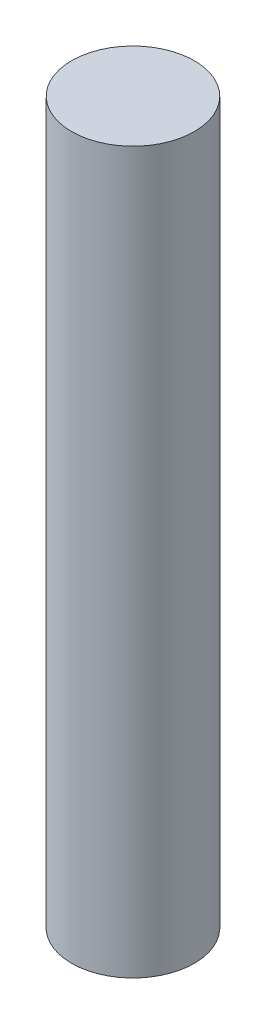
ISO-10303-21;
HEADER;
FILE_DESCRIPTION(('STEP AP214'),'2;1');
FILE_NAME('part.step','',(''),(''),'','','');
FILE_SCHEMA(('AUTOMOTIVE_DESIGN { 1 0 10303 214 1 1 1 1 }'));
ENDSEC;
DATA;
#1=APPLICATION_CONTEXT('core data for automotive mechanical design processes');
#2=APPLICATION_PROTOCOL_DEFINITION('international standard','automotive_design',2000,#1);
#3=PRODUCT_CONTEXT('',#1,'mechanical');
#4=PRODUCT('Part','Part','',(#3));
#5=PRODUCT_RELATED_PRODUCT_CATEGORY('part','',(#4));
#6=PRODUCT_DEFINITION_FORMATION('','',#4);
#7=PRODUCT_DEFINITION_CONTEXT('part definition',#1,'design');
#8=PRODUCT_DEFINITION('design','',#6,#7);
#9=PRODUCT_DEFINITION_SHAPE('','',#8);
#10=(LENGTH_UNIT() NAMED_UNIT(*) SI_UNIT(.MILLI.,.METRE.));
#11=(NAMED_UNIT(*) PLANE_ANGLE_UNIT() SI_UNIT($,.RADIAN.));
#12=(NAMED_UNIT(*) SI_UNIT($,.STERADIAN.) SOLID_ANGLE_UNIT());
#13=UNCERTAINTY_MEASURE_WITH_UNIT(LENGTH_MEASURE(1.E-05),#10,'distance_accuracy_value','');
#14=(GEOMETRIC_REPRESENTATION_CONTEXT(3) GLOBAL_UNCERTAINTY_ASSIGNED_CONTEXT((#13)) GLOBAL_UNIT_ASSIGNED_CONTEXT((#10,
#11,#12)) REPRESENTATION_CONTEXT('',''));
#15=CARTESIAN_POINT('',(0.,0.,0.));
#16=DIRECTION('',(0.,0.,1.));
#17=DIRECTION('',(1.,0.,0.));
#18=AXIS2_PLACEMENT_3D('',#15,#16,#17);
#19=CARTESIAN_POINT('',(0.,27.94,0.));
#20=DIRECTION('',(0.,-1.,0.));
#21=DIRECTION('',(0.,0.,-1.));
#22=AXIS2_PLACEMENT_3D('',#19,#20,#21);
#23=CYLINDRICAL_SURFACE('',#22,4.7625);
#24=CARTESIAN_POINT('',(0.,27.94,0.));
#25=DIRECTION('',(0.,1.,0.));
#26=DIRECTION('',(0.,0.,1.));
#27=AXIS2_PLACEMENT_3D('',#24,#25,#26);
#28=CIRCLE('',#27,4.7625);
#29=CARTESIAN_POINT('',(0.,27.94,4.7625));
#30=VERTEX_POINT('',#29);
#31=EDGE_CURVE('E10',#30,#30,#28,.T.);
#32=ORIENTED_EDGE('',*,*,#31,.F.);
#33=EDGE_LOOP('',(#32));
#34=FACE_BOUND('',#33,.T.);
#35=CARTESIAN_POINT('',(0.,-27.94,0.));
#36=DIRECTION('',(0.,1.,0.));
#37=DIRECTION('',(0.,0.,1.));
#38=AXIS2_PLACEMENT_3D('',#35,#36,#37);
#39=CIRCLE('',#38,4.7625);
#40=CARTESIAN_POINT('',(0.,-27.94,4.7625));
#41=VERTEX_POINT('',#40);
#42=EDGE_CURVE('E36',#41,#41,#39,.T.);
#43=ORIENTED_EDGE('',*,*,#42,.T.);
#44=EDGE_LOOP('',(#43));
#45=FACE_BOUND('',#44,.T.);
#46=ADVANCED_FACE('F33',(#34,#45),#23,.T.);
#47=CARTESIAN_POINT('',(0.,27.94,0.));
#48=DIRECTION('',(0.,1.,0.));
#49=DIRECTION('',(0.,0.,1.));
#50=AXIS2_PLACEMENT_3D('',#47,#48,#49);
#51=PLANE('',#50);
#52=ORIENTED_EDGE('',*,*,#31,.T.);
#53=EDGE_LOOP('',(#52));
#54=FACE_BOUND('',#53,.T.);
#55=ADVANCED_FACE('F48',(#54),#51,.T.);
#56=CARTESIAN_POINT('',(0.,-27.94,0.));
#57=DIRECTION('',(0.,1.,0.));
#58=DIRECTION('',(0.,0.,1.));
#59=AXIS2_PLACEMENT_3D('',#56,#57,#58);
#60=PLANE('',#59);
#61=ORIENTED_EDGE('',*,*,#42,.F.);
#62=EDGE_LOOP('',(#61));
#63=FACE_BOUND('',#62,.T.);
#64=ADVANCED_FACE('F46',(#63),#60,.F.);
#65=CLOSED_SHELL('',(#46,#55,#64));
#66=MANIFOLD_SOLID_BREP('B2',#65);
#67=ADVANCED_BREP_SHAPE_REPRESENTATION('',(#18,#66),#14);
#68=SHAPE_DEFINITION_REPRESENTATION(#9,#67);
ENDSEC;
END-ISO-10303-21;
